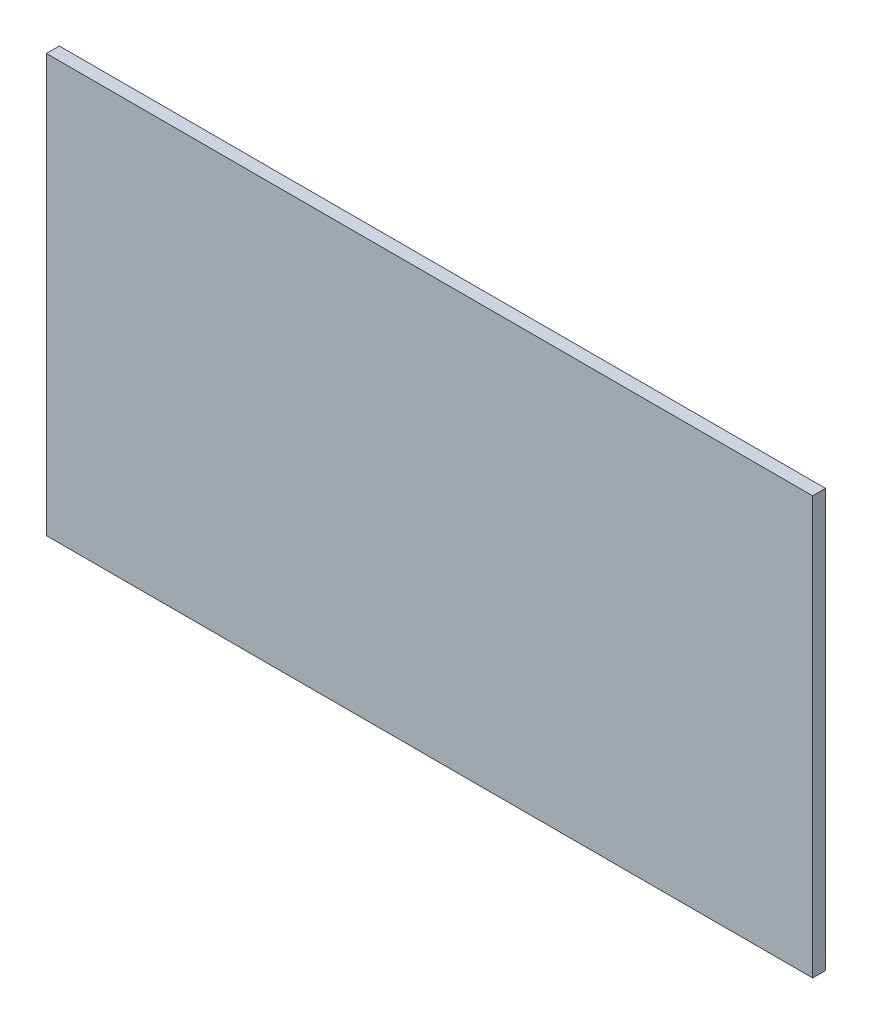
ISO-10303-21;
HEADER;
FILE_DESCRIPTION(('STEP AP214'),'2;1');
FILE_NAME('part.step','',(''),(''),'','','');
FILE_SCHEMA(('AUTOMOTIVE_DESIGN { 1 0 10303 214 1 1 1 1 }'));
ENDSEC;
DATA;
#1=APPLICATION_CONTEXT('core data for automotive mechanical design processes');
#2=APPLICATION_PROTOCOL_DEFINITION('international standard','automotive_design',2000,#1);
#3=PRODUCT_CONTEXT('',#1,'mechanical');
#4=PRODUCT('Part','Part','',(#3));
#5=PRODUCT_RELATED_PRODUCT_CATEGORY('part','',(#4));
#6=PRODUCT_DEFINITION_FORMATION('','',#4);
#7=PRODUCT_DEFINITION_CONTEXT('part definition',#1,'design');
#8=PRODUCT_DEFINITION('design','',#6,#7);
#9=PRODUCT_DEFINITION_SHAPE('','',#8);
#10=(LENGTH_UNIT() NAMED_UNIT(*) SI_UNIT(.MILLI.,.METRE.));
#11=(NAMED_UNIT(*) PLANE_ANGLE_UNIT() SI_UNIT($,.RADIAN.));
#12=(NAMED_UNIT(*) SI_UNIT($,.STERADIAN.) SOLID_ANGLE_UNIT());
#13=UNCERTAINTY_MEASURE_WITH_UNIT(LENGTH_MEASURE(1.E-05),#10,'distance_accuracy_value','');
#14=(GEOMETRIC_REPRESENTATION_CONTEXT(3) GLOBAL_UNCERTAINTY_ASSIGNED_CONTEXT((#13)) GLOBAL_UNIT_ASSIGNED_CONTEXT((#10,
#11,#12)) REPRESENTATION_CONTEXT('',''));
#15=CARTESIAN_POINT('',(0.,0.,0.));
#16=DIRECTION('',(0.,0.,1.));
#17=DIRECTION('',(1.,0.,0.));
#18=AXIS2_PLACEMENT_3D('',#15,#16,#17);
#19=CARTESIAN_POINT('',(0.,0.,6.));
#20=DIRECTION('',(0.,1.,0.));
#21=DIRECTION('',(0.,0.,1.));
#22=AXIS2_PLACEMENT_3D('',#19,#20,#21);
#23=PLANE('',#22);
#24=DIRECTION('',(1.,0.,0.));
#25=VECTOR('',#24,1.);
#26=CARTESIAN_POINT('',(0.,0.,0.));
#27=LINE('',#26,#25);
#28=CARTESIAN_POINT('',(0.,0.,0.));
#29=VERTEX_POINT('',#28);
#30=CARTESIAN_POINT('',(356.,0.,0.));
#31=VERTEX_POINT('',#30);
#32=EDGE_CURVE('E99',#29,#31,#27,.T.);
#33=ORIENTED_EDGE('',*,*,#32,.T.);
#34=DIRECTION('',(0.,0.,-1.));
#35=VECTOR('',#34,1.);
#36=CARTESIAN_POINT('',(356.,0.,6.));
#37=LINE('',#36,#35);
#38=CARTESIAN_POINT('',(356.,0.,6.));
#39=VERTEX_POINT('',#38);
#40=EDGE_CURVE('E11',#39,#31,#37,.T.);
#41=ORIENTED_EDGE('',*,*,#40,.F.);
#42=DIRECTION('',(1.,0.,0.));
#43=VECTOR('',#42,1.);
#44=CARTESIAN_POINT('',(0.,0.,6.));
#45=LINE('',#44,#43);
#46=CARTESIAN_POINT('',(0.,0.,6.));
#47=VERTEX_POINT('',#46);
#48=EDGE_CURVE('E85',#47,#39,#45,.T.);
#49=ORIENTED_EDGE('',*,*,#48,.F.);
#50=DIRECTION('',(0.,0.,-1.));
#51=VECTOR('',#50,1.);
#52=CARTESIAN_POINT('',(0.,0.,6.));
#53=LINE('',#52,#51);
#54=EDGE_CURVE('E52',#47,#29,#53,.T.);
#55=ORIENTED_EDGE('',*,*,#54,.T.);
#56=EDGE_LOOP('',(#33,#41,#49,#55));
#57=FACE_BOUND('',#56,.T.);
#58=ADVANCED_FACE('F36',(#57),#23,.F.);
#59=CARTESIAN_POINT('',(356.,0.,6.));
#60=DIRECTION('',(-1.,0.,0.));
#61=DIRECTION('',(0.,0.,1.));
#62=AXIS2_PLACEMENT_3D('',#59,#60,#61);
#63=PLANE('',#62);
#64=DIRECTION('',(0.,1.,0.));
#65=VECTOR('',#64,1.);
#66=CARTESIAN_POINT('',(356.,0.,0.));
#67=LINE('',#66,#65);
#68=CARTESIAN_POINT('',(356.,194.,0.));
#69=VERTEX_POINT('',#68);
#70=EDGE_CURVE('E90',#31,#69,#67,.T.);
#71=ORIENTED_EDGE('',*,*,#70,.T.);
#72=DIRECTION('',(0.,0.,-1.));
#73=VECTOR('',#72,1.);
#74=CARTESIAN_POINT('',(356.,194.,6.));
#75=LINE('',#74,#73);
#76=CARTESIAN_POINT('',(356.,194.,6.));
#77=VERTEX_POINT('',#76);
#78=EDGE_CURVE('E44',#77,#69,#75,.T.);
#79=ORIENTED_EDGE('',*,*,#78,.F.);
#80=DIRECTION('',(0.,1.,0.));
#81=VECTOR('',#80,1.);
#82=CARTESIAN_POINT('',(356.,0.,6.));
#83=LINE('',#82,#81);
#84=EDGE_CURVE('E77',#39,#77,#83,.T.);
#85=ORIENTED_EDGE('',*,*,#84,.F.);
#86=ORIENTED_EDGE('',*,*,#40,.T.);
#87=EDGE_LOOP('',(#71,#79,#85,#86));
#88=FACE_BOUND('',#87,.T.);
#89=ADVANCED_FACE('F89',(#88),#63,.F.);
#90=CARTESIAN_POINT('',(0.,194.,6.));
#91=DIRECTION('',(0.,1.,0.));
#92=DIRECTION('',(0.,0.,1.));
#93=AXIS2_PLACEMENT_3D('',#90,#91,#92);
#94=PLANE('',#93);
#95=DIRECTION('',(1.,0.,0.));
#96=VECTOR('',#95,1.);
#97=CARTESIAN_POINT('',(0.,194.,0.));
#98=LINE('',#97,#96);
#99=CARTESIAN_POINT('',(0.,194.,0.));
#100=VERTEX_POINT('',#99);
#101=EDGE_CURVE('E102',#100,#69,#98,.T.);
#102=ORIENTED_EDGE('',*,*,#101,.F.);
#103=DIRECTION('',(0.,0.,-1.));
#104=VECTOR('',#103,1.);
#105=CARTESIAN_POINT('',(0.,194.,6.));
#106=LINE('',#105,#104);
#107=CARTESIAN_POINT('',(0.,194.,6.));
#108=VERTEX_POINT('',#107);
#109=EDGE_CURVE('E66',#108,#100,#106,.T.);
#110=ORIENTED_EDGE('',*,*,#109,.F.);
#111=DIRECTION('',(1.,0.,0.));
#112=VECTOR('',#111,1.);
#113=CARTESIAN_POINT('',(0.,194.,6.));
#114=LINE('',#113,#112);
#115=EDGE_CURVE('E84',#108,#77,#114,.T.);
#116=ORIENTED_EDGE('',*,*,#115,.T.);
#117=ORIENTED_EDGE('',*,*,#78,.T.);
#118=EDGE_LOOP('',(#102,#110,#116,#117));
#119=FACE_BOUND('',#118,.T.);
#120=ADVANCED_FACE('F93',(#119),#94,.T.);
#121=CARTESIAN_POINT('',(0.,0.,6.));
#122=DIRECTION('',(-1.,0.,0.));
#123=DIRECTION('',(0.,0.,1.));
#124=AXIS2_PLACEMENT_3D('',#121,#122,#123);
#125=PLANE('',#124);
#126=DIRECTION('',(0.,1.,0.));
#127=VECTOR('',#126,1.);
#128=CARTESIAN_POINT('',(0.,0.,0.));
#129=LINE('',#128,#127);
#130=EDGE_CURVE('E104',#29,#100,#129,.T.);
#131=ORIENTED_EDGE('',*,*,#130,.F.);
#132=ORIENTED_EDGE('',*,*,#54,.F.);
#133=DIRECTION('',(0.,1.,0.));
#134=VECTOR('',#133,1.);
#135=CARTESIAN_POINT('',(0.,0.,6.));
#136=LINE('',#135,#134);
#137=EDGE_CURVE('E94',#47,#108,#136,.T.);
#138=ORIENTED_EDGE('',*,*,#137,.T.);
#139=ORIENTED_EDGE('',*,*,#109,.T.);
#140=EDGE_LOOP('',(#131,#132,#138,#139));
#141=FACE_BOUND('',#140,.T.);
#142=ADVANCED_FACE('F110',(#141),#125,.T.);
#143=CARTESIAN_POINT('',(0.,0.,6.));
#144=DIRECTION('',(0.,0.,1.));
#145=DIRECTION('',(1.,0.,0.));
#146=AXIS2_PLACEMENT_3D('',#143,#144,#145);
#147=PLANE('',#146);
#148=ORIENTED_EDGE('',*,*,#48,.T.);
#149=ORIENTED_EDGE('',*,*,#84,.T.);
#150=ORIENTED_EDGE('',*,*,#115,.F.);
#151=ORIENTED_EDGE('',*,*,#137,.F.);
#152=EDGE_LOOP('',(#148,#149,#150,#151));
#153=FACE_BOUND('',#152,.T.);
#154=ADVANCED_FACE('F81',(#153),#147,.T.);
#155=CARTESIAN_POINT('',(0.,0.,0.));
#156=DIRECTION('',(0.,0.,1.));
#157=DIRECTION('',(1.,0.,0.));
#158=AXIS2_PLACEMENT_3D('',#155,#156,#157);
#159=PLANE('',#158);
#160=ORIENTED_EDGE('',*,*,#32,.F.);
#161=ORIENTED_EDGE('',*,*,#130,.T.);
#162=ORIENTED_EDGE('',*,*,#101,.T.);
#163=ORIENTED_EDGE('',*,*,#70,.F.);
#164=EDGE_LOOP('',(#160,#161,#162,#163));
#165=FACE_BOUND('',#164,.T.);
#166=ADVANCED_FACE('F109',(#165),#159,.F.);
#167=CLOSED_SHELL('',(#58,#89,#120,#142,#154,#166));
#168=MANIFOLD_SOLID_BREP('B2',#167);
#169=ADVANCED_BREP_SHAPE_REPRESENTATION('',(#18,#168),#14);
#170=SHAPE_DEFINITION_REPRESENTATION(#9,#169);
ENDSEC;
END-ISO-10303-21;
